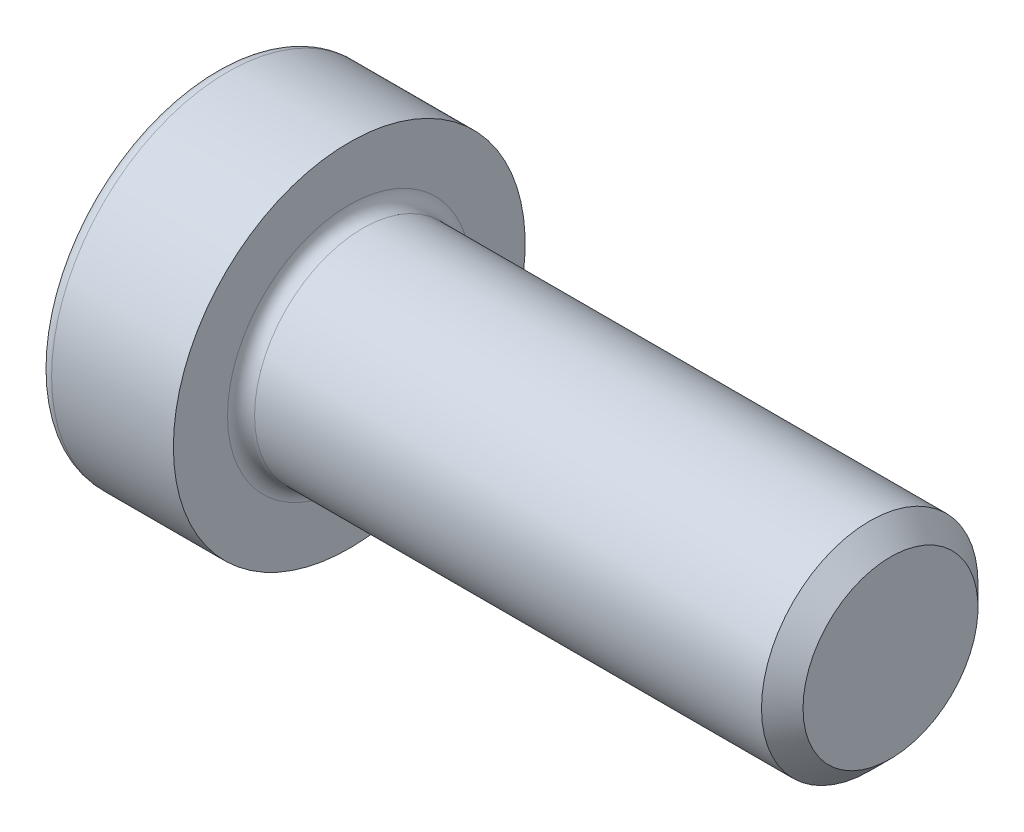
ISO-10303-21;
HEADER;
FILE_DESCRIPTION(('STEP AP214'),'2;1');
FILE_NAME('part.step','',(''),(''),'','','');
FILE_SCHEMA(('AUTOMOTIVE_DESIGN { 1 0 10303 214 1 1 1 1 }'));
ENDSEC;
DATA;
#1=APPLICATION_CONTEXT('core data for automotive mechanical design processes');
#2=APPLICATION_PROTOCOL_DEFINITION('international standard','automotive_design',2000,#1);
#3=PRODUCT_CONTEXT('',#1,'mechanical');
#4=PRODUCT('Part','Part','',(#3));
#5=PRODUCT_RELATED_PRODUCT_CATEGORY('part','',(#4));
#6=PRODUCT_DEFINITION_FORMATION('','',#4);
#7=PRODUCT_DEFINITION_CONTEXT('part definition',#1,'design');
#8=PRODUCT_DEFINITION('design','',#6,#7);
#9=PRODUCT_DEFINITION_SHAPE('','',#8);
#10=(LENGTH_UNIT() NAMED_UNIT(*) SI_UNIT(.MILLI.,.METRE.));
#11=(NAMED_UNIT(*) PLANE_ANGLE_UNIT() SI_UNIT($,.RADIAN.));
#12=(NAMED_UNIT(*) SI_UNIT($,.STERADIAN.) SOLID_ANGLE_UNIT());
#13=UNCERTAINTY_MEASURE_WITH_UNIT(LENGTH_MEASURE(1.E-05),#10,'distance_accuracy_value','');
#14=(GEOMETRIC_REPRESENTATION_CONTEXT(3) GLOBAL_UNCERTAINTY_ASSIGNED_CONTEXT((#13)) GLOBAL_UNIT_ASSIGNED_CONTEXT((#10,
#11,#12)) REPRESENTATION_CONTEXT('',''));
#15=CARTESIAN_POINT('',(0.,0.,0.));
#16=DIRECTION('',(0.,0.,1.));
#17=DIRECTION('',(1.,0.,0.));
#18=AXIS2_PLACEMENT_3D('',#15,#16,#17);
#19=CARTESIAN_POINT('',(-2.5,0.,0.));
#20=DIRECTION('',(1.,0.,0.));
#21=DIRECTION('',(0.,0.,-1.));
#22=AXIS2_PLACEMENT_3D('',#19,#20,#21);
#23=PLANE('',#22);
#24=DIRECTION('',(0.,-0.5,-0.866025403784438));
#25=VECTOR('',#24,1.);
#26=CARTESIAN_POINT('',(-2.5,-1.44337567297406,2.5));
#27=LINE('',#26,#25);
#28=CARTESIAN_POINT('',(-2.5,-1.44337567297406,2.5));
#29=VERTEX_POINT('',#28);
#30=CARTESIAN_POINT('',(-2.50000000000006,-2.16506350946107,1.24999999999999));
#31=VERTEX_POINT('',#30);
#32=EDGE_CURVE('E107',#29,#31,#27,.T.);
#33=ORIENTED_EDGE('',*,*,#32,.F.);
#34=DIRECTION('',(0.,1.,0.));
#35=VECTOR('',#34,1.);
#36=CARTESIAN_POINT('',(-2.5,0.,2.5));
#37=LINE('',#36,#35);
#38=CARTESIAN_POINT('',(-2.50000000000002,0.,2.49999999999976));
#39=VERTEX_POINT('',#38);
#40=EDGE_CURVE('E102',#39,#29,#37,.F.);
#41=ORIENTED_EDGE('',*,*,#40,.F.);
#42=CARTESIAN_POINT('',(-2.50000000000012,0.,0.));
#43=DIRECTION('',(-1.,0.,0.));
#44=DIRECTION('',(0.,0.,1.));
#45=AXIS2_PLACEMENT_3D('',#42,#43,#44);
#46=CIRCLE('',#45,2.49999999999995);
#47=EDGE_CURVE('E104',#39,#31,#46,.F.);
#48=ORIENTED_EDGE('',*,*,#47,.T.);
#49=EDGE_LOOP('',(#33,#41,#48));
#50=FACE_BOUND('',#49,.T.);
#51=ADVANCED_FACE('F17',(#50),#23,.F.);
#52=CARTESIAN_POINT('',(-2.5,0.,0.));
#53=DIRECTION('',(1.,0.,0.));
#54=DIRECTION('',(0.,0.,-1.));
#55=AXIS2_PLACEMENT_3D('',#52,#53,#54);
#56=PLANE('',#55);
#57=DIRECTION('',(0.,0.499999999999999,-0.866025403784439));
#58=VECTOR('',#57,1.);
#59=CARTESIAN_POINT('',(-2.5,-2.88675134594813,0.));
#60=LINE('',#59,#58);
#61=CARTESIAN_POINT('',(-2.5,-2.88675134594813,0.));
#62=VERTEX_POINT('',#61);
#63=CARTESIAN_POINT('',(-2.50000000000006,-2.16506350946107,-1.24999999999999));
#64=VERTEX_POINT('',#63);
#65=EDGE_CURVE('E165',#62,#64,#60,.T.);
#66=ORIENTED_EDGE('',*,*,#65,.F.);
#67=DIRECTION('',(0.,-0.499999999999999,-0.866025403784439));
#68=VECTOR('',#67,1.);
#69=CARTESIAN_POINT('',(-2.5,-2.1650635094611,1.25));
#70=LINE('',#69,#68);
#71=EDGE_CURVE('E169',#31,#62,#70,.T.);
#72=ORIENTED_EDGE('',*,*,#71,.F.);
#73=CARTESIAN_POINT('',(-2.50000000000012,0.,0.));
#74=DIRECTION('',(-1.,0.,0.));
#75=DIRECTION('',(0.,0.,1.));
#76=AXIS2_PLACEMENT_3D('',#73,#74,#75);
#77=CIRCLE('',#76,2.49999999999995);
#78=EDGE_CURVE('E122',#31,#64,#77,.F.);
#79=ORIENTED_EDGE('',*,*,#78,.T.);
#80=EDGE_LOOP('',(#66,#72,#79));
#81=FACE_BOUND('',#80,.T.);
#82=ADVANCED_FACE('F540',(#81),#56,.F.);
#83=CARTESIAN_POINT('',(-2.5,0.,0.));
#84=DIRECTION('',(1.,0.,0.));
#85=DIRECTION('',(0.,0.,-1.));
#86=AXIS2_PLACEMENT_3D('',#83,#84,#85);
#87=PLANE('',#86);
#88=DIRECTION('',(0.,1.,0.));
#89=VECTOR('',#88,1.);
#90=CARTESIAN_POINT('',(-2.5,0.,-2.5));
#91=LINE('',#90,#89);
#92=CARTESIAN_POINT('',(-2.5,-1.44337567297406,-2.5));
#93=VERTEX_POINT('',#92);
#94=CARTESIAN_POINT('',(-2.50000000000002,0.,-2.49999999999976));
#95=VERTEX_POINT('',#94);
#96=EDGE_CURVE('E157',#93,#95,#91,.T.);
#97=ORIENTED_EDGE('',*,*,#96,.F.);
#98=DIRECTION('',(0.,0.5,-0.866025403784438));
#99=VECTOR('',#98,1.);
#100=CARTESIAN_POINT('',(-2.5,-2.1650635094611,-1.25));
#101=LINE('',#100,#99);
#102=EDGE_CURVE('E161',#64,#93,#101,.T.);
#103=ORIENTED_EDGE('',*,*,#102,.F.);
#104=CARTESIAN_POINT('',(-2.50000000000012,0.,0.));
#105=DIRECTION('',(-1.,0.,0.));
#106=DIRECTION('',(0.,0.,1.));
#107=AXIS2_PLACEMENT_3D('',#104,#105,#106);
#108=CIRCLE('',#107,2.49999999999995);
#109=EDGE_CURVE('E218',#64,#95,#108,.F.);
#110=ORIENTED_EDGE('',*,*,#109,.T.);
#111=EDGE_LOOP('',(#97,#103,#110));
#112=FACE_BOUND('',#111,.T.);
#113=ADVANCED_FACE('F531',(#112),#87,.F.);
#114=CARTESIAN_POINT('',(-2.5,0.,0.));
#115=DIRECTION('',(1.,0.,0.));
#116=DIRECTION('',(0.,0.,-1.));
#117=AXIS2_PLACEMENT_3D('',#114,#115,#116);
#118=PLANE('',#117);
#119=DIRECTION('',(0.,0.5,0.866025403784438));
#120=VECTOR('',#119,1.);
#121=CARTESIAN_POINT('',(-2.5,1.44337567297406,-2.5));
#122=LINE('',#121,#120);
#123=CARTESIAN_POINT('',(-2.5,1.44337567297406,-2.5));
#124=VERTEX_POINT('',#123);
#125=CARTESIAN_POINT('',(-2.50000000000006,2.16506350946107,-1.24999999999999));
#126=VERTEX_POINT('',#125);
#127=EDGE_CURVE('E149',#124,#126,#122,.T.);
#128=ORIENTED_EDGE('',*,*,#127,.F.);
#129=DIRECTION('',(0.,1.,0.));
#130=VECTOR('',#129,1.);
#131=CARTESIAN_POINT('',(-2.5,0.,-2.5));
#132=LINE('',#131,#130);
#133=EDGE_CURVE('E153',#95,#124,#132,.T.);
#134=ORIENTED_EDGE('',*,*,#133,.F.);
#135=CARTESIAN_POINT('',(-2.50000000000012,0.,0.));
#136=DIRECTION('',(-1.,0.,0.));
#137=DIRECTION('',(0.,0.,1.));
#138=AXIS2_PLACEMENT_3D('',#135,#136,#137);
#139=CIRCLE('',#138,2.49999999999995);
#140=EDGE_CURVE('E215',#95,#126,#139,.F.);
#141=ORIENTED_EDGE('',*,*,#140,.T.);
#142=EDGE_LOOP('',(#128,#134,#141));
#143=FACE_BOUND('',#142,.T.);
#144=ADVANCED_FACE('F522',(#143),#118,.F.);
#145=CARTESIAN_POINT('',(-2.5,0.,0.));
#146=DIRECTION('',(1.,0.,0.));
#147=DIRECTION('',(0.,0.,-1.));
#148=AXIS2_PLACEMENT_3D('',#145,#146,#147);
#149=PLANE('',#148);
#150=DIRECTION('',(0.,-0.499999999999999,0.866025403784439));
#151=VECTOR('',#150,1.);
#152=CARTESIAN_POINT('',(-2.5,2.88675134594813,0.));
#153=LINE('',#152,#151);
#154=CARTESIAN_POINT('',(-2.5,2.88675134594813,0.));
#155=VERTEX_POINT('',#154);
#156=CARTESIAN_POINT('',(-2.50000000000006,2.16506350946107,1.24999999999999));
#157=VERTEX_POINT('',#156);
#158=EDGE_CURVE('E123',#155,#157,#153,.T.);
#159=ORIENTED_EDGE('',*,*,#158,.F.);
#160=DIRECTION('',(0.,0.499999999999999,0.866025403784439));
#161=VECTOR('',#160,1.);
#162=CARTESIAN_POINT('',(-2.5,2.1650635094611,-1.25));
#163=LINE('',#162,#161);
#164=EDGE_CURVE('E145',#126,#155,#163,.T.);
#165=ORIENTED_EDGE('',*,*,#164,.F.);
#166=CARTESIAN_POINT('',(-2.50000000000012,0.,0.));
#167=DIRECTION('',(-1.,0.,0.));
#168=DIRECTION('',(0.,0.,1.));
#169=AXIS2_PLACEMENT_3D('',#166,#167,#168);
#170=CIRCLE('',#169,2.49999999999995);
#171=EDGE_CURVE('E131',#126,#157,#170,.F.);
#172=ORIENTED_EDGE('',*,*,#171,.T.);
#173=EDGE_LOOP('',(#159,#165,#172));
#174=FACE_BOUND('',#173,.T.);
#175=ADVANCED_FACE('F513',(#174),#149,.F.);
#176=CARTESIAN_POINT('',(-2.49999999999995,0.,0.));
#177=DIRECTION('',(-1.,0.,0.));
#178=DIRECTION('',(0.,0.,1.));
#179=AXIS2_PLACEMENT_3D('',#176,#177,#178);
#180=CONICAL_SURFACE('',#179,2.4999999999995,1.1902899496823);
#181=CARTESIAN_POINT('',(-1.50000000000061,0.,8.88178419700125E-13));
#182=VERTEX_POINT('',#181);
#183=VERTEX_LOOP('',#182);
#184=FACE_BOUND('',#183,.T.);
#185=ORIENTED_EDGE('',*,*,#47,.F.);
#186=CARTESIAN_POINT('',(-2.50000000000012,0.,0.));
#187=DIRECTION('',(-1.,0.,0.));
#188=DIRECTION('',(0.,0.,1.));
#189=AXIS2_PLACEMENT_3D('',#186,#187,#188);
#190=CIRCLE('',#189,2.49999999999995);
#191=EDGE_CURVE('E118',#39,#157,#190,.T.);
#192=ORIENTED_EDGE('',*,*,#191,.T.);
#193=ORIENTED_EDGE('',*,*,#171,.F.);
#194=ORIENTED_EDGE('',*,*,#140,.F.);
#195=ORIENTED_EDGE('',*,*,#109,.F.);
#196=ORIENTED_EDGE('',*,*,#78,.F.);
#197=EDGE_LOOP('',(#185,#192,#193,#194,#195,#196));
#198=FACE_BOUND('',#197,.T.);
#199=ADVANCED_FACE('F116',(#184,#198),#180,.F.);
#200=CARTESIAN_POINT('',(-2.5,0.,0.));
#201=DIRECTION('',(1.,0.,0.));
#202=DIRECTION('',(0.,0.,-1.));
#203=AXIS2_PLACEMENT_3D('',#200,#201,#202);
#204=PLANE('',#203);
#205=DIRECTION('',(0.,1.,0.));
#206=VECTOR('',#205,1.);
#207=CARTESIAN_POINT('',(-2.5,1.44337567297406,2.5));
#208=LINE('',#207,#206);
#209=CARTESIAN_POINT('',(-2.5,1.44337567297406,2.5));
#210=VERTEX_POINT('',#209);
#211=EDGE_CURVE('E127',#210,#39,#208,.F.);
#212=ORIENTED_EDGE('',*,*,#211,.F.);
#213=DIRECTION('',(0.,0.5,-0.866025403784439));
#214=VECTOR('',#213,1.);
#215=CARTESIAN_POINT('',(-2.5,2.88675134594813,0.));
#216=LINE('',#215,#214);
#217=EDGE_CURVE('E130',#157,#210,#216,.F.);
#218=ORIENTED_EDGE('',*,*,#217,.F.);
#219=ORIENTED_EDGE('',*,*,#191,.F.);
#220=EDGE_LOOP('',(#212,#218,#219));
#221=FACE_BOUND('',#220,.T.);
#222=ADVANCED_FACE('F126',(#221),#204,.F.);
#223=CARTESIAN_POINT('',(-2.5,1.44337567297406,2.5));
#224=DIRECTION('',(0.,0.,-1.));
#225=DIRECTION('',(-1.,0.,0.));
#226=AXIS2_PLACEMENT_3D('',#223,#224,#225);
#227=PLANE('',#226);
#228=DIRECTION('',(0.,1.,0.));
#229=VECTOR('',#228,1.);
#230=CARTESIAN_POINT('',(-5.,0.,2.5));
#231=LINE('',#230,#229);
#232=CARTESIAN_POINT('',(-5.,-1.44337567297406,2.5));
#233=VERTEX_POINT('',#232);
#234=CARTESIAN_POINT('',(-5.,1.44337567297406,2.5));
#235=VERTEX_POINT('',#234);
#236=EDGE_CURVE('E202',#233,#235,#231,.T.);
#237=ORIENTED_EDGE('',*,*,#236,.T.);
#238=DIRECTION('',(1.,0.,0.));
#239=VECTOR('',#238,1.);
#240=CARTESIAN_POINT('',(-2.5,1.44337567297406,2.5));
#241=LINE('',#240,#239);
#242=EDGE_CURVE('E135',#210,#235,#241,.F.);
#243=ORIENTED_EDGE('',*,*,#242,.F.);
#244=ORIENTED_EDGE('',*,*,#211,.T.);
#245=ORIENTED_EDGE('',*,*,#40,.T.);
#246=DIRECTION('',(1.,0.,0.));
#247=VECTOR('',#246,1.);
#248=CARTESIAN_POINT('',(-2.5,-1.44337567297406,2.5));
#249=LINE('',#248,#247);
#250=EDGE_CURVE('E198',#233,#29,#249,.T.);
#251=ORIENTED_EDGE('',*,*,#250,.F.);
#252=EDGE_LOOP('',(#237,#243,#244,#245,#251));
#253=FACE_BOUND('',#252,.T.);
#254=ADVANCED_FACE('F133',(#253),#227,.T.);
#255=CARTESIAN_POINT('',(-2.5,2.88675134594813,0.));
#256=DIRECTION('',(0.,-0.866025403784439,-0.5));
#257=DIRECTION('',(0.,0.5,-0.866025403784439));
#258=AXIS2_PLACEMENT_3D('',#255,#256,#257);
#259=PLANE('',#258);
#260=DIRECTION('',(0.,0.5,-0.866025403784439));
#261=VECTOR('',#260,1.);
#262=CARTESIAN_POINT('',(-5.,1.44337567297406,2.5));
#263=LINE('',#262,#261);
#264=CARTESIAN_POINT('',(-5.,2.88675134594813,0.));
#265=VERTEX_POINT('',#264);
#266=EDGE_CURVE('E313',#235,#265,#263,.T.);
#267=ORIENTED_EDGE('',*,*,#266,.T.);
#268=DIRECTION('',(1.,0.,0.));
#269=VECTOR('',#268,1.);
#270=CARTESIAN_POINT('',(-2.5,2.88675134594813,0.));
#271=LINE('',#270,#269);
#272=EDGE_CURVE('E180',#155,#265,#271,.F.);
#273=ORIENTED_EDGE('',*,*,#272,.F.);
#274=ORIENTED_EDGE('',*,*,#158,.T.);
#275=ORIENTED_EDGE('',*,*,#217,.T.);
#276=ORIENTED_EDGE('',*,*,#242,.T.);
#277=EDGE_LOOP('',(#267,#273,#274,#275,#276));
#278=FACE_BOUND('',#277,.T.);
#279=ADVANCED_FACE('F311',(#278),#259,.T.);
#280=CARTESIAN_POINT('',(-2.5,1.44337567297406,-2.5));
#281=DIRECTION('',(0.,-0.866025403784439,0.5));
#282=DIRECTION('',(0.,-0.5,-0.866025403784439));
#283=AXIS2_PLACEMENT_3D('',#280,#281,#282);
#284=PLANE('',#283);
#285=DIRECTION('',(0.,-0.5,-0.866025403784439));
#286=VECTOR('',#285,1.);
#287=CARTESIAN_POINT('',(-5.,2.88675134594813,0.));
#288=LINE('',#287,#286);
#289=CARTESIAN_POINT('',(-5.,1.44337567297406,-2.5));
#290=VERTEX_POINT('',#289);
#291=EDGE_CURVE('E321',#265,#290,#288,.T.);
#292=ORIENTED_EDGE('',*,*,#291,.T.);
#293=DIRECTION('',(1.,0.,0.));
#294=VECTOR('',#293,1.);
#295=CARTESIAN_POINT('',(-2.5,1.44337567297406,-2.5));
#296=LINE('',#295,#294);
#297=EDGE_CURVE('E183',#124,#290,#296,.F.);
#298=ORIENTED_EDGE('',*,*,#297,.F.);
#299=ORIENTED_EDGE('',*,*,#127,.T.);
#300=ORIENTED_EDGE('',*,*,#164,.T.);
#301=ORIENTED_EDGE('',*,*,#272,.T.);
#302=EDGE_LOOP('',(#292,#298,#299,#300,#301));
#303=FACE_BOUND('',#302,.T.);
#304=ADVANCED_FACE('F475',(#303),#284,.T.);
#305=CARTESIAN_POINT('',(-2.5,-1.44337567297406,-2.5));
#306=DIRECTION('',(0.,0.,1.));
#307=DIRECTION('',(1.,0.,0.));
#308=AXIS2_PLACEMENT_3D('',#305,#306,#307);
#309=PLANE('',#308);
#310=DIRECTION('',(0.,1.,0.));
#311=VECTOR('',#310,1.);
#312=CARTESIAN_POINT('',(-5.,0.,-2.5));
#313=LINE('',#312,#311);
#314=CARTESIAN_POINT('',(-5.,-1.44337567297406,-2.5));
#315=VERTEX_POINT('',#314);
#316=EDGE_CURVE('E323',#290,#315,#313,.F.);
#317=ORIENTED_EDGE('',*,*,#316,.T.);
#318=DIRECTION('',(1.,0.,0.));
#319=VECTOR('',#318,1.);
#320=CARTESIAN_POINT('',(-2.5,-1.44337567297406,-2.5));
#321=LINE('',#320,#319);
#322=EDGE_CURVE('E188',#93,#315,#321,.F.);
#323=ORIENTED_EDGE('',*,*,#322,.F.);
#324=ORIENTED_EDGE('',*,*,#96,.T.);
#325=ORIENTED_EDGE('',*,*,#133,.T.);
#326=ORIENTED_EDGE('',*,*,#297,.T.);
#327=EDGE_LOOP('',(#317,#323,#324,#325,#326));
#328=FACE_BOUND('',#327,.T.);
#329=ADVANCED_FACE('F466',(#328),#309,.T.);
#330=CARTESIAN_POINT('',(-2.5,-2.88675134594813,0.));
#331=DIRECTION('',(0.,0.866025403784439,0.5));
#332=DIRECTION('',(0.,-0.5,0.866025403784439));
#333=AXIS2_PLACEMENT_3D('',#330,#331,#332);
#334=PLANE('',#333);
#335=DIRECTION('',(0.,-0.5,0.866025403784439));
#336=VECTOR('',#335,1.);
#337=CARTESIAN_POINT('',(-5.,-1.44337567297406,-2.5));
#338=LINE('',#337,#336);
#339=CARTESIAN_POINT('',(-5.,-2.88675134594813,0.));
#340=VERTEX_POINT('',#339);
#341=EDGE_CURVE('E327',#315,#340,#338,.T.);
#342=ORIENTED_EDGE('',*,*,#341,.T.);
#343=DIRECTION('',(1.,0.,0.));
#344=VECTOR('',#343,1.);
#345=CARTESIAN_POINT('',(-2.5,-2.88675134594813,0.));
#346=LINE('',#345,#344);
#347=EDGE_CURVE('E193',#62,#340,#346,.F.);
#348=ORIENTED_EDGE('',*,*,#347,.F.);
#349=ORIENTED_EDGE('',*,*,#65,.T.);
#350=ORIENTED_EDGE('',*,*,#102,.T.);
#351=ORIENTED_EDGE('',*,*,#322,.T.);
#352=EDGE_LOOP('',(#342,#348,#349,#350,#351));
#353=FACE_BOUND('',#352,.T.);
#354=ADVANCED_FACE('F458',(#353),#334,.T.);
#355=CARTESIAN_POINT('',(-2.5,-1.44337567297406,2.5));
#356=DIRECTION('',(0.,0.866025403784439,-0.5));
#357=DIRECTION('',(0.,0.5,0.866025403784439));
#358=AXIS2_PLACEMENT_3D('',#355,#356,#357);
#359=PLANE('',#358);
#360=DIRECTION('',(0.,0.5,0.866025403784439));
#361=VECTOR('',#360,1.);
#362=CARTESIAN_POINT('',(-5.,-2.88675134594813,0.));
#363=LINE('',#362,#361);
#364=EDGE_CURVE('E329',#340,#233,#363,.T.);
#365=ORIENTED_EDGE('',*,*,#364,.T.);
#366=ORIENTED_EDGE('',*,*,#250,.T.);
#367=ORIENTED_EDGE('',*,*,#32,.T.);
#368=ORIENTED_EDGE('',*,*,#71,.T.);
#369=ORIENTED_EDGE('',*,*,#347,.T.);
#370=EDGE_LOOP('',(#365,#366,#367,#368,#369));
#371=FACE_BOUND('',#370,.T.);
#372=ADVANCED_FACE('F451',(#371),#359,.T.);
#373=CARTESIAN_POINT('',(-5.,0.,0.));
#374=DIRECTION('',(1.,0.,0.));
#375=DIRECTION('',(0.,0.,-1.));
#376=AXIS2_PLACEMENT_3D('',#373,#374,#375);
#377=PLANE('',#376);
#378=ORIENTED_EDGE('',*,*,#341,.F.);
#379=ORIENTED_EDGE('',*,*,#316,.F.);
#380=ORIENTED_EDGE('',*,*,#291,.F.);
#381=ORIENTED_EDGE('',*,*,#266,.F.);
#382=ORIENTED_EDGE('',*,*,#236,.F.);
#383=ORIENTED_EDGE('',*,*,#364,.F.);
#384=EDGE_LOOP('',(#378,#379,#380,#381,#382,#383));
#385=FACE_BOUND('',#384,.T.);
#386=CARTESIAN_POINT('',(-5.,0.,0.));
#387=DIRECTION('',(1.,0.,0.));
#388=DIRECTION('',(0.,0.,1.));
#389=AXIS2_PLACEMENT_3D('',#386,#387,#388);
#390=CIRCLE('',#389,6.);
#391=CARTESIAN_POINT('',(-5.,0.,6.));
#392=VERTEX_POINT('',#391);
#393=CARTESIAN_POINT('',(-5.,0.,-6.));
#394=VERTEX_POINT('',#393);
#395=EDGE_CURVE('E332',#392,#394,#390,.T.);
#396=ORIENTED_EDGE('',*,*,#395,.F.);
#397=CARTESIAN_POINT('',(-5.,0.,0.));
#398=DIRECTION('',(1.,0.,0.));
#399=DIRECTION('',(0.,0.,-1.));
#400=AXIS2_PLACEMENT_3D('',#397,#398,#399);
#401=CIRCLE('',#400,6.);
#402=EDGE_CURVE('E282',#394,#392,#401,.T.);
#403=ORIENTED_EDGE('',*,*,#402,.F.);
#404=EDGE_LOOP('',(#396,#403));
#405=FACE_BOUND('',#404,.T.);
#406=ADVANCED_FACE('F291',(#385,#405),#377,.F.);
#407=CARTESIAN_POINT('',(-4.5,0.,0.));
#408=DIRECTION('',(-1.,0.,0.));
#409=DIRECTION('',(0.,0.,1.));
#410=AXIS2_PLACEMENT_3D('',#407,#408,#409);
#411=TOROIDAL_SURFACE('',#410,6.,0.499999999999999);
#412=ORIENTED_EDGE('',*,*,#395,.T.);
#413=ORIENTED_EDGE('',*,*,#402,.T.);
#414=EDGE_LOOP('',(#412,#413));
#415=FACE_BOUND('',#414,.T.);
#416=CARTESIAN_POINT('',(-4.5,0.,0.));
#417=DIRECTION('',(-1.,0.,0.));
#418=DIRECTION('',(0.,0.,1.));
#419=AXIS2_PLACEMENT_3D('',#416,#417,#418);
#420=CIRCLE('',#419,6.5);
#421=CARTESIAN_POINT('',(-4.5,0.,6.5));
#422=VERTEX_POINT('',#421);
#423=EDGE_CURVE('E211',#422,#422,#420,.F.);
#424=ORIENTED_EDGE('',*,*,#423,.F.);
#425=EDGE_LOOP('',(#424));
#426=FACE_BOUND('',#425,.T.);
#427=ADVANCED_FACE('F286',(#415,#426),#411,.T.);
#428=CARTESIAN_POINT('',(20.,0.,0.));
#429=DIRECTION('',(-1.,0.,0.));
#430=DIRECTION('',(0.,0.,1.));
#431=AXIS2_PLACEMENT_3D('',#428,#429,#430);
#432=CYLINDRICAL_SURFACE('',#431,6.5);
#433=ORIENTED_EDGE('',*,*,#423,.T.);
#434=EDGE_LOOP('',(#433));
#435=FACE_BOUND('',#434,.T.);
#436=CARTESIAN_POINT('',(0.,0.,0.));
#437=DIRECTION('',(-1.,0.,0.));
#438=DIRECTION('',(0.,0.,1.));
#439=AXIS2_PLACEMENT_3D('',#436,#437,#438);
#440=CIRCLE('',#439,6.5);
#441=CARTESIAN_POINT('',(0.,0.,6.5));
#442=VERTEX_POINT('',#441);
#443=EDGE_CURVE('E209',#442,#442,#440,.T.);
#444=ORIENTED_EDGE('',*,*,#443,.T.);
#445=EDGE_LOOP('',(#444));
#446=FACE_BOUND('',#445,.T.);
#447=ADVANCED_FACE('F290',(#435,#446),#432,.T.);
#448=CARTESIAN_POINT('',(20.,3.233,0.));
#449=DIRECTION('',(-1.,0.,0.));
#450=DIRECTION('',(0.,0.,1.));
#451=AXIS2_PLACEMENT_3D('',#448,#449,#450);
#452=PLANE('',#451);
#453=CARTESIAN_POINT('',(20.0000000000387,0.,0.));
#454=DIRECTION('',(-1.,0.,0.));
#455=DIRECTION('',(0.,0.,1.));
#456=AXIS2_PLACEMENT_3D('',#453,#454,#455);
#457=CIRCLE('',#456,3.23299999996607);
#458=CARTESIAN_POINT('',(20.0000000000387,0.,3.23299999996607));
#459=VERTEX_POINT('',#458);
#460=EDGE_CURVE('E205',#459,#459,#457,.T.);
#461=ORIENTED_EDGE('',*,*,#460,.F.);
#462=EDGE_LOOP('',(#461));
#463=FACE_BOUND('',#462,.T.);
#464=ADVANCED_FACE('F259',(#463),#452,.F.);
#465=CARTESIAN_POINT('',(0.,6.5,0.));
#466=DIRECTION('',(-1.,0.,0.));
#467=DIRECTION('',(0.,0.,1.));
#468=AXIS2_PLACEMENT_3D('',#465,#466,#467);
#469=PLANE('',#468);
#470=CARTESIAN_POINT('',(0.,0.,0.));
#471=DIRECTION('',(1.,0.,0.));
#472=DIRECTION('',(0.,0.,1.));
#473=AXIS2_PLACEMENT_3D('',#470,#471,#472);
#474=CIRCLE('',#473,4.5);
#475=CARTESIAN_POINT('',(0.,0.,-4.5));
#476=VERTEX_POINT('',#475);
#477=CARTESIAN_POINT('',(0.,0.,4.5));
#478=VERTEX_POINT('',#477);
#479=EDGE_CURVE('E208',#476,#478,#474,.F.);
#480=ORIENTED_EDGE('',*,*,#479,.T.);
#481=CARTESIAN_POINT('',(0.,0.,0.));
#482=DIRECTION('',(1.,0.,0.));
#483=DIRECTION('',(0.,0.,-1.));
#484=AXIS2_PLACEMENT_3D('',#481,#482,#483);
#485=CIRCLE('',#484,4.5);
#486=EDGE_CURVE('E36',#478,#476,#485,.F.);
#487=ORIENTED_EDGE('',*,*,#486,.T.);
#488=EDGE_LOOP('',(#480,#487));
#489=FACE_BOUND('',#488,.T.);
#490=ORIENTED_EDGE('',*,*,#443,.F.);
#491=EDGE_LOOP('',(#490));
#492=FACE_BOUND('',#491,.T.);
#493=ADVANCED_FACE('F250',(#489,#492),#469,.F.);
#494=CARTESIAN_POINT('',(19.2330000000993,0.,0.));
#495=DIRECTION('',(-1.,0.,0.));
#496=DIRECTION('',(0.,0.,1.));
#497=AXIS2_PLACEMENT_3D('',#494,#495,#496);
#498=CONICAL_SURFACE('',#497,3.99999999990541,0.785398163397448);
#499=CARTESIAN_POINT('',(19.233,0.,0.));
#500=DIRECTION('',(-1.,0.,0.));
#501=DIRECTION('',(0.,0.,1.));
#502=AXIS2_PLACEMENT_3D('',#499,#500,#501);
#503=CIRCLE('',#502,4.);
#504=CARTESIAN_POINT('',(19.233,0.,4.));
#505=VERTEX_POINT('',#504);
#506=EDGE_CURVE('E28',#505,#505,#503,.T.);
#507=ORIENTED_EDGE('',*,*,#506,.F.);
#508=EDGE_LOOP('',(#507));
#509=FACE_BOUND('',#508,.T.);
#510=ORIENTED_EDGE('',*,*,#460,.T.);
#511=EDGE_LOOP('',(#510));
#512=FACE_BOUND('',#511,.T.);
#513=ADVANCED_FACE('F239',(#509,#512),#498,.T.);
#514=CARTESIAN_POINT('',(0.499999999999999,0.,0.));
#515=DIRECTION('',(-1.,0.,0.));
#516=DIRECTION('',(0.,0.,1.));
#517=AXIS2_PLACEMENT_3D('',#514,#515,#516);
#518=TOROIDAL_SURFACE('',#517,4.5,0.499999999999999);
#519=ORIENTED_EDGE('',*,*,#486,.F.);
#520=ORIENTED_EDGE('',*,*,#479,.F.);
#521=EDGE_LOOP('',(#519,#520));
#522=FACE_BOUND('',#521,.T.);
#523=CARTESIAN_POINT('',(0.5,0.,0.));
#524=DIRECTION('',(-1.,0.,0.));
#525=DIRECTION('',(0.,0.,1.));
#526=AXIS2_PLACEMENT_3D('',#523,#524,#525);
#527=CIRCLE('',#526,4.);
#528=CARTESIAN_POINT('',(0.5,0.,4.));
#529=VERTEX_POINT('',#528);
#530=EDGE_CURVE('E11',#529,#529,#527,.F.);
#531=ORIENTED_EDGE('',*,*,#530,.F.);
#532=EDGE_LOOP('',(#531));
#533=FACE_BOUND('',#532,.T.);
#534=ADVANCED_FACE('F227',(#522,#533),#518,.F.);
#535=CARTESIAN_POINT('',(20.,0.,0.));
#536=DIRECTION('',(-1.,0.,0.));
#537=DIRECTION('',(0.,0.,1.));
#538=AXIS2_PLACEMENT_3D('',#535,#536,#537);
#539=CYLINDRICAL_SURFACE('',#538,4.);
#540=ORIENTED_EDGE('',*,*,#530,.T.);
#541=EDGE_LOOP('',(#540));
#542=FACE_BOUND('',#541,.T.);
#543=ORIENTED_EDGE('',*,*,#506,.T.);
#544=EDGE_LOOP('',(#543));
#545=FACE_BOUND('',#544,.T.);
#546=ADVANCED_FACE('F238',(#542,#545),#539,.T.);
#547=CLOSED_SHELL('',(#51,#82,#113,#144,#175,#199,#222,#254,#279,#304,#329,#354,#372,#406,#427,
#447,#464,#493,#513,#534,#546));
#548=MANIFOLD_SOLID_BREP('B1',#547);
#549=ADVANCED_BREP_SHAPE_REPRESENTATION('',(#18,#548),#14);
#550=SHAPE_DEFINITION_REPRESENTATION(#9,#549);
ENDSEC;
END-ISO-10303-21;
